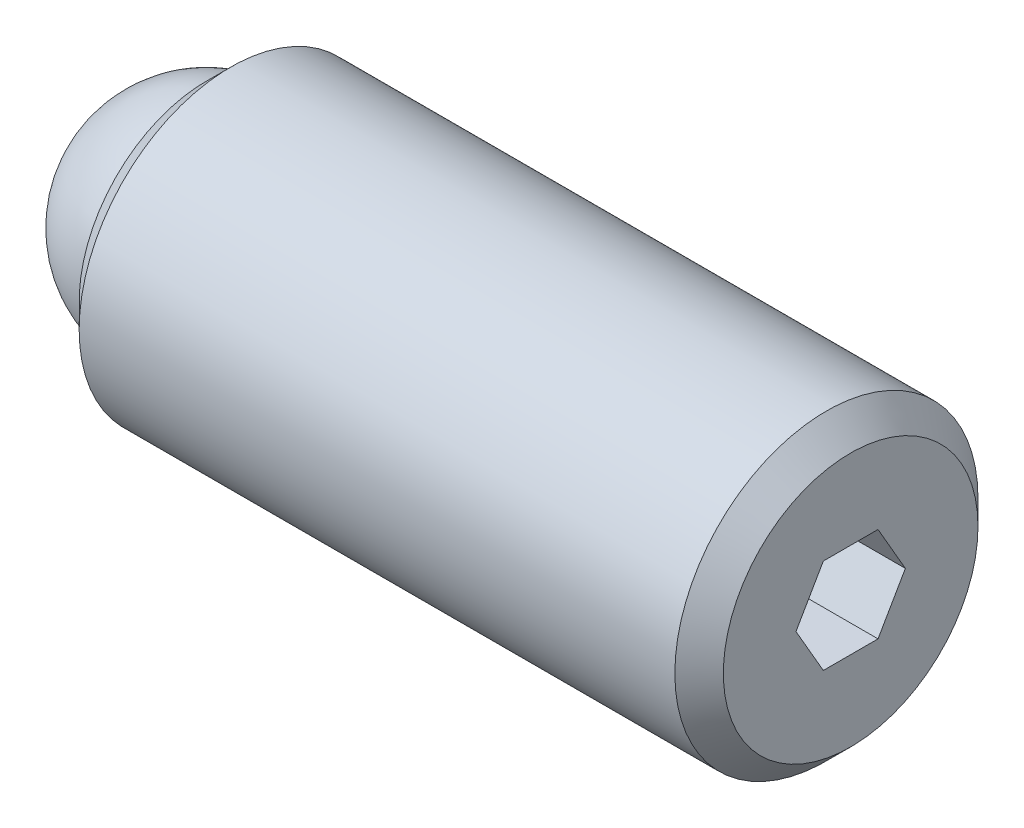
ISO-10303-21;
HEADER;
FILE_DESCRIPTION(('STEP AP214'),'2;1');
FILE_NAME('part.step','',(''),(''),'','','');
FILE_SCHEMA(('AUTOMOTIVE_DESIGN { 1 0 10303 214 1 1 1 1 }'));
ENDSEC;
DATA;
#1=APPLICATION_CONTEXT('core data for automotive mechanical design processes');
#2=APPLICATION_PROTOCOL_DEFINITION('international standard','automotive_design',2000,#1);
#3=PRODUCT_CONTEXT('',#1,'mechanical');
#4=PRODUCT('Part','Part','',(#3));
#5=PRODUCT_RELATED_PRODUCT_CATEGORY('part','',(#4));
#6=PRODUCT_DEFINITION_FORMATION('','',#4);
#7=PRODUCT_DEFINITION_CONTEXT('part definition',#1,'design');
#8=PRODUCT_DEFINITION('design','',#6,#7);
#9=PRODUCT_DEFINITION_SHAPE('','',#8);
#10=(LENGTH_UNIT() NAMED_UNIT(*) SI_UNIT(.MILLI.,.METRE.));
#11=(NAMED_UNIT(*) PLANE_ANGLE_UNIT() SI_UNIT($,.RADIAN.));
#12=(NAMED_UNIT(*) SI_UNIT($,.STERADIAN.) SOLID_ANGLE_UNIT());
#13=UNCERTAINTY_MEASURE_WITH_UNIT(LENGTH_MEASURE(1.E-05),#10,'distance_accuracy_value','');
#14=(GEOMETRIC_REPRESENTATION_CONTEXT(3) GLOBAL_UNCERTAINTY_ASSIGNED_CONTEXT((#13)) GLOBAL_UNIT_ASSIGNED_CONTEXT((#10,
#11,#12)) REPRESENTATION_CONTEXT('',''));
#15=CARTESIAN_POINT('',(0.,0.,0.));
#16=DIRECTION('',(0.,0.,1.));
#17=DIRECTION('',(1.,0.,0.));
#18=AXIS2_PLACEMENT_3D('',#15,#16,#17);
#19=CARTESIAN_POINT('',(0.,0.,0.));
#20=DIRECTION('',(0.,-1.,0.));
#21=DIRECTION('',(0.,0.,1.));
#22=AXIS2_PLACEMENT_3D('',#19,#20,#21);
#23=SPHERICAL_SURFACE('',#22,2.38125);
#24=CARTESIAN_POINT('',(0.,-2.38125,0.));
#25=VERTEX_POINT('',#24);
#26=VERTEX_LOOP('',#25);
#27=FACE_BOUND('',#26,.T.);
#28=ADVANCED_FACE('F41',(#27),#23,.T.);
#29=CLOSED_SHELL('',(#28));
#30=MANIFOLD_SOLID_BREP('B2',#29);
#31=CARTESIAN_POINT('',(13.49375,0.,0.));
#32=DIRECTION('',(-1.,0.,0.));
#33=DIRECTION('',(0.,0.,1.));
#34=AXIS2_PLACEMENT_3D('',#31,#32,#33);
#35=CYLINDRICAL_SURFACE('',#34,3.175);
#36=CARTESIAN_POINT('',(12.98575,0.,0.));
#37=DIRECTION('',(1.,0.,0.));
#38=DIRECTION('',(0.,0.,-1.));
#39=AXIS2_PLACEMENT_3D('',#36,#37,#38);
#40=CIRCLE('',#39,3.175);
#41=CARTESIAN_POINT('',(12.98575,0.,-3.175));
#42=VERTEX_POINT('',#41);
#43=EDGE_CURVE('E39',#42,#42,#40,.F.);
#44=ORIENTED_EDGE('',*,*,#43,.T.);
#45=EDGE_LOOP('',(#44));
#46=FACE_BOUND('',#45,.T.);
#47=CARTESIAN_POINT('',(0.508,0.,0.));
#48=DIRECTION('',(1.,0.,0.));
#49=DIRECTION('',(0.,0.,-1.));
#50=AXIS2_PLACEMENT_3D('',#47,#48,#49);
#51=CIRCLE('',#50,3.175);
#52=CARTESIAN_POINT('',(0.508,0.,-3.175));
#53=VERTEX_POINT('',#52);
#54=EDGE_CURVE('E157',#53,#53,#51,.T.);
#55=ORIENTED_EDGE('',*,*,#54,.T.);
#56=EDGE_LOOP('',(#55));
#57=FACE_BOUND('',#56,.T.);
#58=ADVANCED_FACE('F54',(#46,#57),#35,.T.);
#59=CARTESIAN_POINT('',(13.49375,0.,0.));
#60=DIRECTION('',(1.,0.,0.));
#61=DIRECTION('',(0.,0.,-1.));
#62=AXIS2_PLACEMENT_3D('',#59,#60,#61);
#63=PLANE('',#62);
#64=DIRECTION('',(0.,0.866025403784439,-0.5));
#65=VECTOR('',#64,1.);
#66=CARTESIAN_POINT('',(13.49375,-0.9921875,-0.572839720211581));
#67=LINE('',#66,#65);
#68=CARTESIAN_POINT('',(13.49375,-0.9921875,-0.572839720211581));
#69=VERTEX_POINT('',#68);
#70=CARTESIAN_POINT('',(13.49375,0.,-1.14567944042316));
#71=VERTEX_POINT('',#70);
#72=EDGE_CURVE('E69',#69,#71,#67,.T.);
#73=ORIENTED_EDGE('',*,*,#72,.F.);
#74=DIRECTION('',(0.,0.,-1.));
#75=VECTOR('',#74,1.);
#76=CARTESIAN_POINT('',(13.49375,-0.9921875,0.572839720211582));
#77=LINE('',#76,#75);
#78=CARTESIAN_POINT('',(13.49375,-0.9921875,0.572839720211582));
#79=VERTEX_POINT('',#78);
#80=EDGE_CURVE('E153',#79,#69,#77,.T.);
#81=ORIENTED_EDGE('',*,*,#80,.F.);
#82=DIRECTION('',(0.,-0.866025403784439,-0.5));
#83=VECTOR('',#82,1.);
#84=CARTESIAN_POINT('',(13.49375,0.,1.14567944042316));
#85=LINE('',#84,#83);
#86=CARTESIAN_POINT('',(13.49375,0.,1.14567944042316));
#87=VERTEX_POINT('',#86);
#88=EDGE_CURVE('E151',#87,#79,#85,.T.);
#89=ORIENTED_EDGE('',*,*,#88,.F.);
#90=DIRECTION('',(0.,-0.866025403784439,0.5));
#91=VECTOR('',#90,1.);
#92=CARTESIAN_POINT('',(13.49375,0.992187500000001,0.572839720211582));
#93=LINE('',#92,#91);
#94=CARTESIAN_POINT('',(13.49375,0.992187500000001,0.572839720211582));
#95=VERTEX_POINT('',#94);
#96=EDGE_CURVE('E117',#95,#87,#93,.T.);
#97=ORIENTED_EDGE('',*,*,#96,.F.);
#98=DIRECTION('',(0.,0.,1.));
#99=VECTOR('',#98,1.);
#100=CARTESIAN_POINT('',(13.49375,0.9921875,-0.572839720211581));
#101=LINE('',#100,#99);
#102=CARTESIAN_POINT('',(13.49375,0.9921875,-0.572839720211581));
#103=VERTEX_POINT('',#102);
#104=EDGE_CURVE('E147',#103,#95,#101,.T.);
#105=ORIENTED_EDGE('',*,*,#104,.F.);
#106=DIRECTION('',(0.,0.866025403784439,0.5));
#107=VECTOR('',#106,1.);
#108=CARTESIAN_POINT('',(13.49375,0.,-1.14567944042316));
#109=LINE('',#108,#107);
#110=EDGE_CURVE('E143',#71,#103,#109,.T.);
#111=ORIENTED_EDGE('',*,*,#110,.F.);
#112=EDGE_LOOP('',(#73,#81,#89,#97,#105,#111));
#113=FACE_BOUND('',#112,.T.);
#114=CARTESIAN_POINT('',(13.49375,0.,0.));
#115=DIRECTION('',(1.,0.,0.));
#116=DIRECTION('',(0.,0.,-1.));
#117=AXIS2_PLACEMENT_3D('',#114,#115,#116);
#118=CIRCLE('',#117,2.667);
#119=CARTESIAN_POINT('',(13.49375,0.,-2.667));
#120=VERTEX_POINT('',#119);
#121=EDGE_CURVE('E62',#120,#120,#118,.T.);
#122=ORIENTED_EDGE('',*,*,#121,.T.);
#123=EDGE_LOOP('',(#122));
#124=FACE_BOUND('',#123,.T.);
#125=ADVANCED_FACE('F170',(#113,#124),#63,.T.);
#126=CARTESIAN_POINT('',(0.,0.,0.));
#127=DIRECTION('',(1.,0.,0.));
#128=DIRECTION('',(0.,0.,-1.));
#129=AXIS2_PLACEMENT_3D('',#126,#127,#128);
#130=PLANE('',#129);
#131=CARTESIAN_POINT('',(0.,0.,0.));
#132=DIRECTION('',(-1.,0.,0.));
#133=DIRECTION('',(0.,0.,1.));
#134=AXIS2_PLACEMENT_3D('',#131,#132,#133);
#135=CIRCLE('',#134,2.38125);
#136=CARTESIAN_POINT('',(0.,0.,2.38125));
#137=VERTEX_POINT('',#136);
#138=EDGE_CURVE('E225',#137,#137,#135,.T.);
#139=ORIENTED_EDGE('',*,*,#138,.F.);
#140=EDGE_LOOP('',(#139));
#141=FACE_BOUND('',#140,.T.);
#142=CARTESIAN_POINT('',(0.,0.,0.));
#143=DIRECTION('',(1.,0.,0.));
#144=DIRECTION('',(0.,0.,-1.));
#145=AXIS2_PLACEMENT_3D('',#142,#143,#144);
#146=CIRCLE('',#145,2.667);
#147=CARTESIAN_POINT('',(0.,0.,-2.667));
#148=VERTEX_POINT('',#147);
#149=EDGE_CURVE('E165',#148,#148,#146,.F.);
#150=ORIENTED_EDGE('',*,*,#149,.T.);
#151=EDGE_LOOP('',(#150));
#152=FACE_BOUND('',#151,.T.);
#153=ADVANCED_FACE('F182',(#141,#152),#130,.F.);
#154=CARTESIAN_POINT('',(0.508,0.,0.));
#155=DIRECTION('',(1.,0.,0.));
#156=DIRECTION('',(0.,0.,-1.));
#157=AXIS2_PLACEMENT_3D('',#154,#155,#156);
#158=CONICAL_SURFACE('',#157,3.175,0.785398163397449);
#159=ORIENTED_EDGE('',*,*,#149,.F.);
#160=EDGE_LOOP('',(#159));
#161=FACE_BOUND('',#160,.T.);
#162=ORIENTED_EDGE('',*,*,#54,.F.);
#163=EDGE_LOOP('',(#162));
#164=FACE_BOUND('',#163,.T.);
#165=ADVANCED_FACE('F174',(#161,#164),#158,.T.);
#166=CARTESIAN_POINT('',(13.49375,0.,0.));
#167=DIRECTION('',(-1.,0.,0.));
#168=DIRECTION('',(0.,0.,1.));
#169=AXIS2_PLACEMENT_3D('',#166,#167,#168);
#170=CONICAL_SURFACE('',#169,2.667,0.785398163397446);
#171=ORIENTED_EDGE('',*,*,#43,.F.);
#172=EDGE_LOOP('',(#171));
#173=FACE_BOUND('',#172,.T.);
#174=ORIENTED_EDGE('',*,*,#121,.F.);
#175=EDGE_LOOP('',(#174));
#176=FACE_BOUND('',#175,.T.);
#177=ADVANCED_FACE('F56',(#173,#176),#170,.T.);
#178=CARTESIAN_POINT('',(11.20775,-0.9921875,-0.572839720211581));
#179=DIRECTION('',(0.,-0.5,-0.866025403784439));
#180=DIRECTION('',(0.,0.866025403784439,-0.5));
#181=AXIS2_PLACEMENT_3D('',#178,#179,#180);
#182=PLANE('',#181);
#183=ORIENTED_EDGE('',*,*,#72,.T.);
#184=DIRECTION('',(1.,0.,0.));
#185=VECTOR('',#184,1.);
#186=CARTESIAN_POINT('',(11.20775,0.,-1.14567944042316));
#187=LINE('',#186,#185);
#188=CARTESIAN_POINT('',(11.20775,0.,-1.14567944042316));
#189=VERTEX_POINT('',#188);
#190=EDGE_CURVE('E99',#189,#71,#187,.T.);
#191=ORIENTED_EDGE('',*,*,#190,.F.);
#192=DIRECTION('',(0.,0.866025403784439,-0.5));
#193=VECTOR('',#192,1.);
#194=CARTESIAN_POINT('',(11.20775,-0.9921875,-0.572839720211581));
#195=LINE('',#194,#193);
#196=CARTESIAN_POINT('',(11.20775,-0.9921875,-0.572839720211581));
#197=VERTEX_POINT('',#196);
#198=EDGE_CURVE('E155',#197,#189,#195,.T.);
#199=ORIENTED_EDGE('',*,*,#198,.F.);
#200=DIRECTION('',(1.,0.,0.));
#201=VECTOR('',#200,1.);
#202=CARTESIAN_POINT('',(11.20775,-0.9921875,-0.572839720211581));
#203=LINE('',#202,#201);
#204=EDGE_CURVE('E77',#197,#69,#203,.T.);
#205=ORIENTED_EDGE('',*,*,#204,.T.);
#206=EDGE_LOOP('',(#183,#191,#199,#205));
#207=FACE_BOUND('',#206,.T.);
#208=ADVANCED_FACE('F173',(#207),#182,.F.);
#209=CARTESIAN_POINT('',(11.20775,-0.9921875,0.572839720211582));
#210=DIRECTION('',(0.,-1.,0.));
#211=DIRECTION('',(0.,0.,-1.));
#212=AXIS2_PLACEMENT_3D('',#209,#210,#211);
#213=PLANE('',#212);
#214=ORIENTED_EDGE('',*,*,#80,.T.);
#215=ORIENTED_EDGE('',*,*,#204,.F.);
#216=DIRECTION('',(0.,0.,-1.));
#217=VECTOR('',#216,1.);
#218=CARTESIAN_POINT('',(11.20775,-0.9921875,0.572839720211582));
#219=LINE('',#218,#217);
#220=CARTESIAN_POINT('',(11.20775,-0.9921875,0.572839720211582));
#221=VERTEX_POINT('',#220);
#222=EDGE_CURVE('E129',#221,#197,#219,.T.);
#223=ORIENTED_EDGE('',*,*,#222,.F.);
#224=DIRECTION('',(1.,0.,0.));
#225=VECTOR('',#224,1.);
#226=CARTESIAN_POINT('',(11.20775,-0.9921875,0.572839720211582));
#227=LINE('',#226,#225);
#228=EDGE_CURVE('E121',#221,#79,#227,.T.);
#229=ORIENTED_EDGE('',*,*,#228,.T.);
#230=EDGE_LOOP('',(#214,#215,#223,#229));
#231=FACE_BOUND('',#230,.T.);
#232=ADVANCED_FACE('F180',(#231),#213,.F.);
#233=CARTESIAN_POINT('',(11.20775,0.,1.14567944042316));
#234=DIRECTION('',(0.,-0.5,0.866025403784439));
#235=DIRECTION('',(0.,-0.866025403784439,-0.5));
#236=AXIS2_PLACEMENT_3D('',#233,#234,#235);
#237=PLANE('',#236);
#238=ORIENTED_EDGE('',*,*,#88,.T.);
#239=ORIENTED_EDGE('',*,*,#228,.F.);
#240=DIRECTION('',(0.,-0.866025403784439,-0.5));
#241=VECTOR('',#240,1.);
#242=CARTESIAN_POINT('',(11.20775,0.,1.14567944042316));
#243=LINE('',#242,#241);
#244=CARTESIAN_POINT('',(11.20775,0.,1.14567944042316));
#245=VERTEX_POINT('',#244);
#246=EDGE_CURVE('E125',#245,#221,#243,.T.);
#247=ORIENTED_EDGE('',*,*,#246,.F.);
#248=DIRECTION('',(1.,0.,0.));
#249=VECTOR('',#248,1.);
#250=CARTESIAN_POINT('',(11.20775,0.,1.14567944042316));
#251=LINE('',#250,#249);
#252=EDGE_CURVE('E110',#245,#87,#251,.T.);
#253=ORIENTED_EDGE('',*,*,#252,.T.);
#254=EDGE_LOOP('',(#238,#239,#247,#253));
#255=FACE_BOUND('',#254,.T.);
#256=ADVANCED_FACE('F126',(#255),#237,.F.);
#257=CARTESIAN_POINT('',(11.20775,0.992187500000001,0.572839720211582));
#258=DIRECTION('',(0.,0.5,0.866025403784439));
#259=DIRECTION('',(0.,-0.866025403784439,0.5));
#260=AXIS2_PLACEMENT_3D('',#257,#258,#259);
#261=PLANE('',#260);
#262=ORIENTED_EDGE('',*,*,#96,.T.);
#263=ORIENTED_EDGE('',*,*,#252,.F.);
#264=DIRECTION('',(0.,-0.866025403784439,0.5));
#265=VECTOR('',#264,1.);
#266=CARTESIAN_POINT('',(11.20775,0.992187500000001,0.572839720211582));
#267=LINE('',#266,#265);
#268=CARTESIAN_POINT('',(11.20775,0.992187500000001,0.572839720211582));
#269=VERTEX_POINT('',#268);
#270=EDGE_CURVE('E114',#269,#245,#267,.T.);
#271=ORIENTED_EDGE('',*,*,#270,.F.);
#272=DIRECTION('',(1.,0.,0.));
#273=VECTOR('',#272,1.);
#274=CARTESIAN_POINT('',(11.20775,0.992187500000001,0.572839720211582));
#275=LINE('',#274,#273);
#276=EDGE_CURVE('E122',#269,#95,#275,.T.);
#277=ORIENTED_EDGE('',*,*,#276,.T.);
#278=EDGE_LOOP('',(#262,#263,#271,#277));
#279=FACE_BOUND('',#278,.T.);
#280=ADVANCED_FACE('F112',(#279),#261,.F.);
#281=CARTESIAN_POINT('',(11.20775,0.9921875,-0.572839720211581));
#282=DIRECTION('',(0.,1.,0.));
#283=DIRECTION('',(0.,0.,1.));
#284=AXIS2_PLACEMENT_3D('',#281,#282,#283);
#285=PLANE('',#284);
#286=ORIENTED_EDGE('',*,*,#104,.T.);
#287=ORIENTED_EDGE('',*,*,#276,.F.);
#288=DIRECTION('',(0.,0.,1.));
#289=VECTOR('',#288,1.);
#290=CARTESIAN_POINT('',(11.20775,0.9921875,-0.572839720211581));
#291=LINE('',#290,#289);
#292=CARTESIAN_POINT('',(11.20775,0.9921875,-0.572839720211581));
#293=VERTEX_POINT('',#292);
#294=EDGE_CURVE('E135',#293,#269,#291,.T.);
#295=ORIENTED_EDGE('',*,*,#294,.F.);
#296=DIRECTION('',(1.,0.,0.));
#297=VECTOR('',#296,1.);
#298=CARTESIAN_POINT('',(11.20775,0.9921875,-0.572839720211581));
#299=LINE('',#298,#297);
#300=EDGE_CURVE('E160',#293,#103,#299,.T.);
#301=ORIENTED_EDGE('',*,*,#300,.T.);
#302=EDGE_LOOP('',(#286,#287,#295,#301));
#303=FACE_BOUND('',#302,.T.);
#304=ADVANCED_FACE('F201',(#303),#285,.F.);
#305=CARTESIAN_POINT('',(11.20775,0.,-1.14567944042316));
#306=DIRECTION('',(0.,0.5,-0.866025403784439));
#307=DIRECTION('',(0.,0.866025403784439,0.5));
#308=AXIS2_PLACEMENT_3D('',#305,#306,#307);
#309=PLANE('',#308);
#310=ORIENTED_EDGE('',*,*,#110,.T.);
#311=ORIENTED_EDGE('',*,*,#300,.F.);
#312=DIRECTION('',(0.,0.866025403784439,0.5));
#313=VECTOR('',#312,1.);
#314=CARTESIAN_POINT('',(11.20775,0.,-1.14567944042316));
#315=LINE('',#314,#313);
#316=EDGE_CURVE('E137',#189,#293,#315,.T.);
#317=ORIENTED_EDGE('',*,*,#316,.F.);
#318=ORIENTED_EDGE('',*,*,#190,.T.);
#319=EDGE_LOOP('',(#310,#311,#317,#318));
#320=FACE_BOUND('',#319,.T.);
#321=ADVANCED_FACE('F198',(#320),#309,.F.);
#322=CARTESIAN_POINT('',(11.20775,0.,0.));
#323=DIRECTION('',(1.,0.,0.));
#324=DIRECTION('',(0.,0.,-1.));
#325=AXIS2_PLACEMENT_3D('',#322,#323,#324);
#326=PLANE('',#325);
#327=ORIENTED_EDGE('',*,*,#198,.T.);
#328=ORIENTED_EDGE('',*,*,#316,.T.);
#329=ORIENTED_EDGE('',*,*,#294,.T.);
#330=ORIENTED_EDGE('',*,*,#270,.T.);
#331=ORIENTED_EDGE('',*,*,#246,.T.);
#332=ORIENTED_EDGE('',*,*,#222,.T.);
#333=EDGE_LOOP('',(#327,#328,#329,#330,#331,#332));
#334=FACE_BOUND('',#333,.T.);
#335=ADVANCED_FACE('F132',(#334),#326,.T.);
#336=CARTESIAN_POINT('',(1.984375,0.,0.));
#337=DIRECTION('',(-1.,0.,0.));
#338=DIRECTION('',(0.,0.,1.));
#339=AXIS2_PLACEMENT_3D('',#336,#337,#338);
#340=CYLINDRICAL_SURFACE('',#339,2.38125);
#341=CARTESIAN_POINT('',(1.984375,0.,0.));
#342=DIRECTION('',(-1.,0.,0.));
#343=DIRECTION('',(0.,0.,1.));
#344=AXIS2_PLACEMENT_3D('',#341,#342,#343);
#345=CIRCLE('',#344,2.38125);
#346=CARTESIAN_POINT('',(1.984375,0.,2.38125));
#347=VERTEX_POINT('',#346);
#348=EDGE_CURVE('E144',#347,#347,#345,.T.);
#349=ORIENTED_EDGE('',*,*,#348,.F.);
#350=EDGE_LOOP('',(#349));
#351=FACE_BOUND('',#350,.T.);
#352=ORIENTED_EDGE('',*,*,#138,.T.);
#353=EDGE_LOOP('',(#352));
#354=FACE_BOUND('',#353,.T.);
#355=ADVANCED_FACE('F214',(#351,#354),#340,.F.);
#356=CARTESIAN_POINT('',(1.984375,0.,0.));
#357=DIRECTION('',(-1.,0.,0.));
#358=DIRECTION('',(0.,0.,1.));
#359=AXIS2_PLACEMENT_3D('',#356,#357,#358);
#360=PLANE('',#359);
#361=ORIENTED_EDGE('',*,*,#348,.T.);
#362=EDGE_LOOP('',(#361));
#363=FACE_BOUND('',#362,.T.);
#364=ADVANCED_FACE('F217',(#363),#360,.T.);
#365=CLOSED_SHELL('',(#58,#125,#153,#165,#177,#208,#232,#256,#280,#304,#321,#335,#355,#364));
#366=MANIFOLD_SOLID_BREP('B6',#365);
#367=ADVANCED_BREP_SHAPE_REPRESENTATION('',(#18,#30,#366),#14);
#368=SHAPE_DEFINITION_REPRESENTATION(#9,#367);
ENDSEC;
END-ISO-10303-21;
